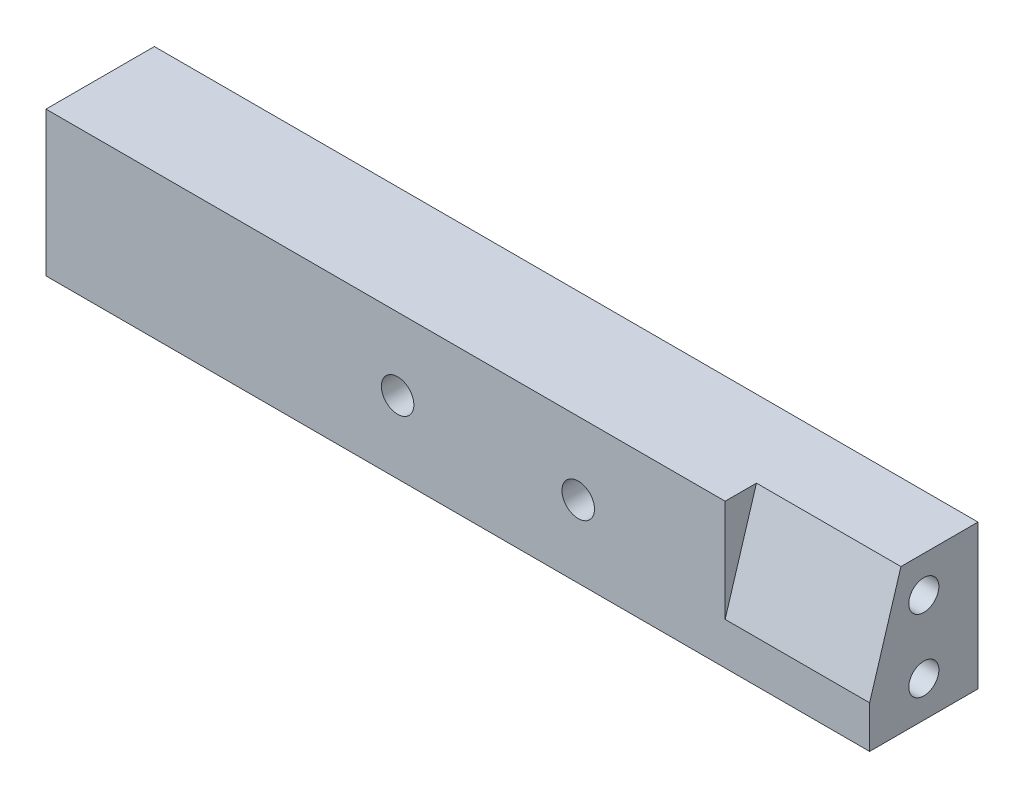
from build123d import *

# Parameters (mm, degrees)
RESSALTO_EXTRUS_O1_DEPTH      = 34.2
FURO_ROSCADO_DE_M3X0_51_D     = 2.5
FURO_ROSCADO_DE_M3X0_51_DEPTH = 8.5
FURO_ROSCADO_DE_M3X0_51_TIP   = 0.751075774
FURO_ROSCADO_DE_M3X0_52_D     = 2.5
FURO_ROSCADO_DE_M3X0_52_DEPTH = 8.5
FURO_ROSCADO_DE_M3X0_52_TIP   = 0.751075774
SKETCH1_R                     = 1.35
CUT_EXTRUDE1_DEPTH            = 36.869764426
CORTE_EXTRUS_O1_DEPTH         = 12


with BuildPart() as part:
    # Esbo_o1 → Ressalto-extrus_o1 (new, symmetric)
    with BuildSketch(Plane(origin=(0, 0, 0), x_dir=(0, 0, -1), z_dir=(1, 0, 0))):
        Polygon((3.026585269, 6), (4.5, 6), (4.5, -6), (-4.5, -6), (-4.5, 6), align=None)
    extrude(amount=RESSALTO_EXTRUS_O1_DEPTH, both=True)

    # Furo roscado de M3x0.51
    with Locations(Plane(origin=(34.2, 0, 0), x_dir=(0, 0, -1), z_dir=(1, 0, 0))):
        with Locations((0, -3), (0, 3)):
            Hole(FURO_ROSCADO_DE_M3X0_51_D / 2, depth=FURO_ROSCADO_DE_M3X0_51_DEPTH)
            with Locations((0, 0, -(FURO_ROSCADO_DE_M3X0_51_DEPTH + FURO_ROSCADO_DE_M3X0_51_TIP / 2))):  # 118° drill point
                Cone(0, FURO_ROSCADO_DE_M3X0_51_D / 2, FURO_ROSCADO_DE_M3X0_51_TIP, mode=Mode.SUBTRACT)

    # Furo roscado de M3x0.52
    with Locations(Plane.ZY.offset(34.2)):
        with Locations((0, 3), (0, -3)):
            Hole(FURO_ROSCADO_DE_M3X0_52_D / 2, depth=FURO_ROSCADO_DE_M3X0_52_DEPTH)
            with Locations((0, 0, -(FURO_ROSCADO_DE_M3X0_52_DEPTH + FURO_ROSCADO_DE_M3X0_52_TIP / 2))):  # 118° drill point
                Cone(0, FURO_ROSCADO_DE_M3X0_52_D / 2, FURO_ROSCADO_DE_M3X0_52_TIP, mode=Mode.SUBTRACT)

    # Sketch1 → Cut-Extrude1 (cut, through all)
    with BuildSketch(Plane(origin=(0, 0, -4.5), x_dir=(-1, 0, 0), z_dir=(0, 0, -1))):
        with Locations((-10, 0)):
            Circle(SKETCH1_R)
        with Locations((5, 0)):
            Circle(SKETCH1_R)
    extrude(amount=-CUT_EXTRUDE1_DEPTH, mode=Mode.SUBTRACT)

    # Esbo_o2 → Corte-extrus_o1 (cut)
    with BuildSketch(Plane(origin=(34.2, 0, 0), x_dir=(0, 0, -1), z_dir=(1, 0, 0))):
        Polygon((-1.9, 6), (-4.5, -2.5), (-4.5, 6), align=None)
    extrude(amount=-CORTE_EXTRUS_O1_DEPTH, mode=Mode.SUBTRACT)


solid = part.part
